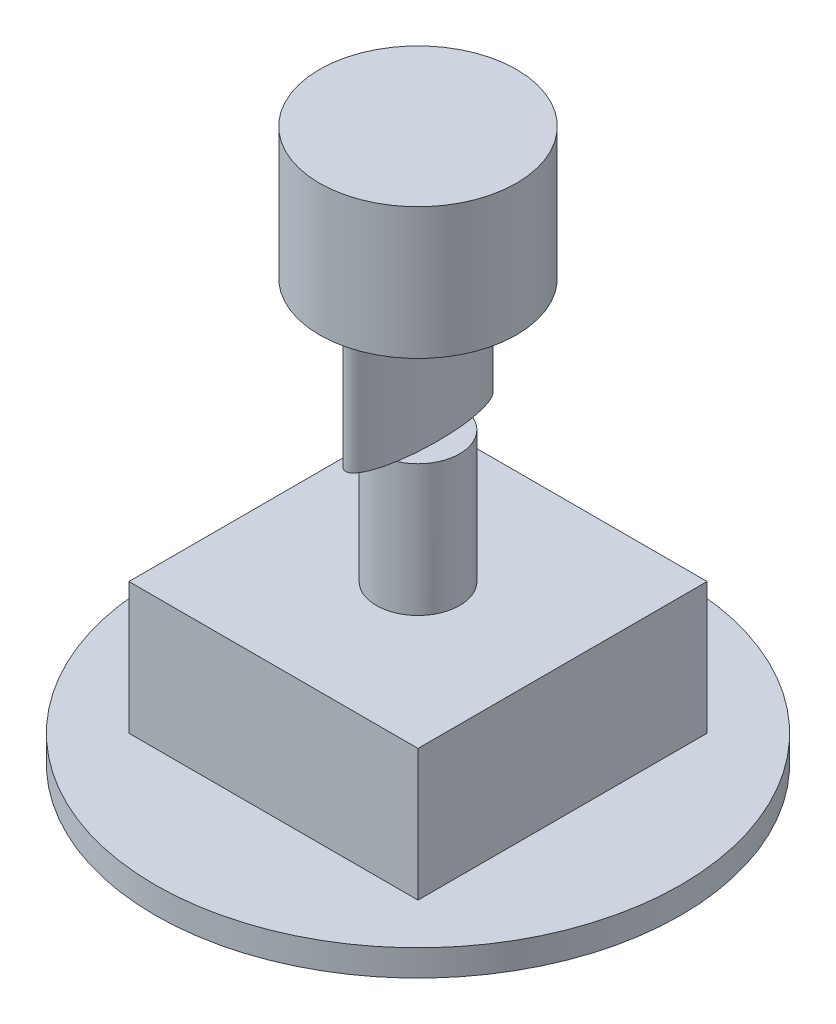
from build123d import *

# Parameters (mm, degrees)
SKIZZE1_R               = 20
LINEAR_AUSTRAGEN1_DEPTH = 1
SKIZZE2_W               = 22
SKIZZE2_H               = 22
LINEAR_AUSTRAGEN2_DEPTH = 10
SKIZZE3_R               = 3.17
LINEAR_AUSTRAGEN3_DEPTH = 10
SKIZZE4_RX              = 5.5
SKIZZE4_RY              = 1.5
LINEAR_AUSTRAGEN4_DEPTH = 10
SKIZZE5_R               = 7.5
LINEAR_AUSTRAGEN5_DEPTH = 10


with BuildPart() as part:
    # Skizze1 → Linear austragen1 (new, symmetric)
    with BuildSketch(Plane(origin=(0, 0, 0), x_dir=(1, 0, 0), z_dir=(0, 1, 0))):
        with Locations(Location((0, 0, 0), (0, 0, 270))):
            Circle(SKIZZE1_R)
    extrude(amount=LINEAR_AUSTRAGEN1_DEPTH, both=True)

    # Skizze2 → Linear austragen2 (add)
    with BuildSketch(Plane(origin=(0, 1, 0), x_dir=(1, 0, 0), z_dir=(0, 1, 0))):
        Rectangle(SKIZZE2_W, SKIZZE2_H)
    extrude(amount=LINEAR_AUSTRAGEN2_DEPTH)

    # Skizze3 → Linear austragen3 (add)
    with BuildSketch(Plane(origin=(0, 11, 0), x_dir=(1, 0, 0), z_dir=(0, 1, 0))):
        with Locations(Location((0, 0, 0), (0, 0, 90))):
            Circle(SKIZZE3_R)
    extrude(amount=LINEAR_AUSTRAGEN3_DEPTH)

    # Skizze4 → Linear austragen4 (add)
    with BuildSketch(Plane(origin=(0, 21, 0), x_dir=(1, 0, 0), z_dir=(0, 1, 0))):
        with Locations(Location((0, 0), (0, 0, -90))):
            Ellipse(SKIZZE4_RX, SKIZZE4_RY)
    extrude(amount=LINEAR_AUSTRAGEN4_DEPTH)

    # Skizze5 → Linear austragen5 (add)
    with BuildSketch(Plane(origin=(0, 31, 0), x_dir=(1, 0, 0), z_dir=(0, 1, 0))):
        with Locations(Location((0, 0, 0), (0, 0, 270))):
            Circle(SKIZZE5_R)
    extrude(amount=LINEAR_AUSTRAGEN5_DEPTH)


solid = part.part
